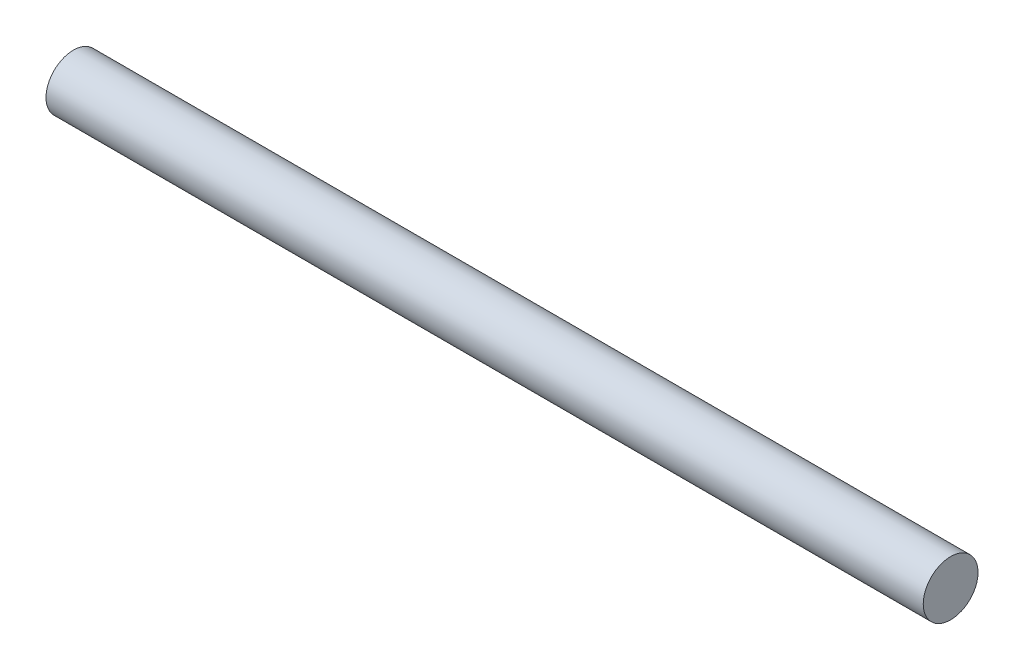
from build123d import *

# Parameters (mm, degrees)
SKETCH1_W = 152.4
SKETCH1_H = 4.7625


with BuildPart() as part:
    # Sketch1 → Revolve1 (revolve)
    with BuildSketch(Plane(origin=(0, 0, 0), x_dir=(1, 0, 0), z_dir=(0, 1, 0)), mode=Mode.PRIVATE) as revolve1_sk:
        with Locations((76.2, 2.38125)):
            Rectangle(SKETCH1_W, SKETCH1_H)
    revolve(revolve1_sk.sketch.rotate(Axis((0, 0, 0), (1, 0, 0)), 180), axis=Axis((0, 0, 0), (1, 0, 0)))


solid = part.part
